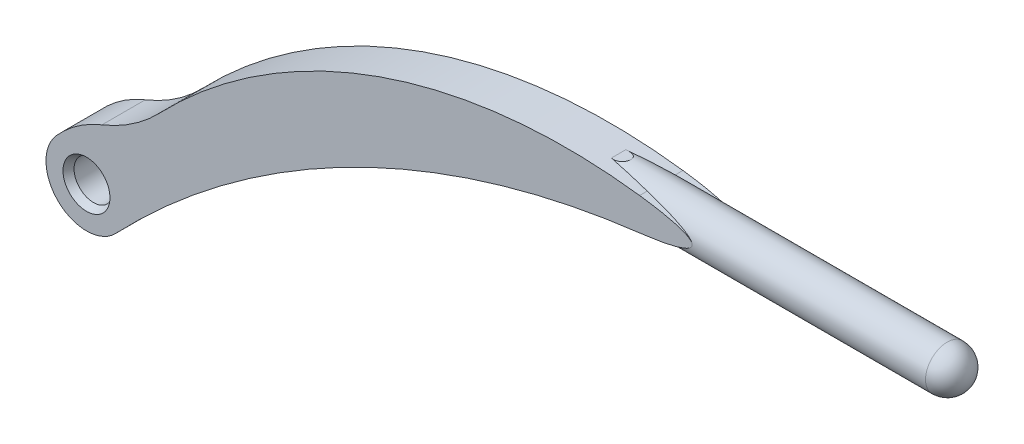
ISO-10303-21;
HEADER;
FILE_DESCRIPTION(('STEP AP214'),'2;1');
FILE_NAME('part.step','',(''),(''),'','','');
FILE_SCHEMA(('AUTOMOTIVE_DESIGN { 1 0 10303 214 1 1 1 1 }'));
ENDSEC;
DATA;
#1=APPLICATION_CONTEXT('core data for automotive mechanical design processes');
#2=APPLICATION_PROTOCOL_DEFINITION('international standard','automotive_design',2000,#1);
#3=PRODUCT_CONTEXT('',#1,'mechanical');
#4=PRODUCT('Part','Part','',(#3));
#5=PRODUCT_RELATED_PRODUCT_CATEGORY('part','',(#4));
#6=PRODUCT_DEFINITION_FORMATION('','',#4);
#7=PRODUCT_DEFINITION_CONTEXT('part definition',#1,'design');
#8=PRODUCT_DEFINITION('design','',#6,#7);
#9=PRODUCT_DEFINITION_SHAPE('','',#8);
#10=(LENGTH_UNIT() NAMED_UNIT(*) SI_UNIT(.MILLI.,.METRE.));
#11=(NAMED_UNIT(*) PLANE_ANGLE_UNIT() SI_UNIT($,.RADIAN.));
#12=(NAMED_UNIT(*) SI_UNIT($,.STERADIAN.) SOLID_ANGLE_UNIT());
#13=UNCERTAINTY_MEASURE_WITH_UNIT(LENGTH_MEASURE(1.E-05),#10,'distance_accuracy_value','');
#14=(GEOMETRIC_REPRESENTATION_CONTEXT(3) GLOBAL_UNCERTAINTY_ASSIGNED_CONTEXT((#13)) GLOBAL_UNIT_ASSIGNED_CONTEXT((#10,
#11,#12)) REPRESENTATION_CONTEXT('',''));
#15=CARTESIAN_POINT('',(0.,0.,0.));
#16=DIRECTION('',(0.,0.,1.));
#17=DIRECTION('',(1.,0.,0.));
#18=AXIS2_PLACEMENT_3D('',#15,#16,#17);
#19=CARTESIAN_POINT('',(34.6920044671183,14.6976624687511,2.7178));
#20=CARTESIAN_POINT('',(42.8662930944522,15.6704272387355,2.7178));
#21=CARTESIAN_POINT('',(34.6920044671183,16.733025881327,2.7178));
#22=(BOUNDED_CURVE() B_SPLINE_CURVE(2,(#19,#20,#21),.UNSPECIFIED.,.F.,
.F.) B_SPLINE_CURVE_WITH_KNOTS((3,3),(0.,1.),
.UNSPECIFIED.) CURVE() GEOMETRIC_REPRESENTATION_ITEM() RATIONAL_B_SPLINE_CURVE((1.,
0.677710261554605,1.)) REPRESENTATION_ITEM(''));
#23=DIRECTION('',(0.,0.,-1.));
#24=VECTOR('',#23,1.);
#25=SURFACE_OF_LINEAR_EXTRUSION('',#22,#24);
#26=CARTESIAN_POINT('',(34.6920044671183,16.733025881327,2.23848737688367));
#27=CARTESIAN_POINT('',(34.7780422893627,16.7218386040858,2.25165778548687));
#28=CARTESIAN_POINT('',(34.8640465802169,16.7102931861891,2.2647485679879));
#29=CARTESIAN_POINT('',(35.0363838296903,16.68634315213,2.29084535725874));
#30=CARTESIAN_POINT('',(35.1227163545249,16.6739346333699,2.3038506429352));
#31=CARTESIAN_POINT('',(35.2955709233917,16.6481775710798,2.32976837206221));
#32=CARTESIAN_POINT('',(35.3820925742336,16.634825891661,2.34268033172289));
#33=CARTESIAN_POINT('',(35.5551824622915,16.607077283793,2.36840059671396));
#34=CARTESIAN_POINT('',(35.6417503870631,16.5926781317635,2.38120861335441));
#35=CARTESIAN_POINT('',(35.8147860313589,16.5627021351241,2.40670861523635));
#36=CARTESIAN_POINT('',(35.9012535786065,16.5471241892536,2.41940047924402));
#37=CARTESIAN_POINT('',(36.0788626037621,16.5136903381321,2.44537434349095));
#38=CARTESIAN_POINT('',(36.1699903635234,16.4957552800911,2.45864887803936));
#39=CARTESIAN_POINT('',(36.3518164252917,16.4580868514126,2.48503905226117));
#40=CARTESIAN_POINT('',(36.4425150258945,16.4383550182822,2.49815481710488));
#41=CARTESIAN_POINT('',(36.6232926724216,16.3966813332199,2.52420668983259));
#42=CARTESIAN_POINT('',(36.7133724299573,16.3747427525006,2.53714303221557));
#43=CARTESIAN_POINT('',(36.892663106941,16.3280166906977,2.5628056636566));
#44=CARTESIAN_POINT('',(36.9818752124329,16.3032339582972,2.57553226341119));
#45=CARTESIAN_POINT('',(37.1591282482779,16.2497729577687,2.60073612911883));
#46=CARTESIAN_POINT('',(37.2471699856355,16.2210975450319,2.61321357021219));
#47=CARTESIAN_POINT('',(37.369039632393,16.1767891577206,2.63042831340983));
#48=CARTESIAN_POINT('',(37.4037447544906,16.1636356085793,2.63532399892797));
#49=CARTESIAN_POINT('',(37.4727119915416,16.1361396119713,2.64503966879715));
#50=CARTESIAN_POINT('',(37.506973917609,16.1217966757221,2.64985962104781));
#51=CARTESIAN_POINT('',(37.5748758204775,16.0916154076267,2.65939866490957));
#52=CARTESIAN_POINT('',(37.6085154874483,16.0757763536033,2.66411770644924));
#53=CARTESIAN_POINT('',(37.6748113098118,16.0421523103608,2.67340424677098));
#54=CARTESIAN_POINT('',(37.7074680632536,16.0243685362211,2.67797183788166));
#55=CARTESIAN_POINT('',(37.7715459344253,15.9859376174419,2.68692025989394));
#56=CARTESIAN_POINT('',(37.8029534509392,15.9652663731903,2.69129906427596));
#57=CARTESIAN_POINT('',(37.8477508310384,15.9312876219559,2.6975340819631));
#58=CARTESIAN_POINT('',(37.8622577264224,15.919505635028,2.69955135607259));
#59=CARTESIAN_POINT('',(37.8901778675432,15.8946991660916,2.70343034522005));
#60=CARTESIAN_POINT('',(37.9035911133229,15.8816746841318,2.7052920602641));
#61=CARTESIAN_POINT('',(37.9346607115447,15.8476471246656,2.70960014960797));
#62=CARTESIAN_POINT('',(37.9514321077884,15.8257291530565,2.71192173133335));
#63=CARTESIAN_POINT('',(37.9715547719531,15.7896832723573,2.71470329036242));
#64=CARTESIAN_POINT('',(37.977448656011,15.7770297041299,2.7155171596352));
#65=CARTESIAN_POINT('',(37.9867739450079,15.7508324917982,2.71680391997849));
#66=CARTESIAN_POINT('',(37.9902134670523,15.7372919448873,2.71727793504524));
#67=CARTESIAN_POINT('',(37.9936391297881,15.7129675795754,2.71774978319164));
#68=CARTESIAN_POINT('',(37.9942405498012,15.7022715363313,2.71783247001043));
#69=CARTESIAN_POINT('',(37.9936007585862,15.6809333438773,2.717744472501));
#70=CARTESIAN_POINT('',(37.9923592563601,15.670291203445,2.71757374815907));
#71=CARTESIAN_POINT('',(37.988181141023,15.6494235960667,2.71699988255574));
#72=CARTESIAN_POINT('',(37.985254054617,15.639196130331,2.71659804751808));
#73=CARTESIAN_POINT('',(37.9779773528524,15.6192605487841,2.71559990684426));
#74=CARTESIAN_POINT('',(37.9736248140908,15.6095535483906,2.71500320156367));
#75=CARTESIAN_POINT('',(37.960241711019,15.5839430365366,2.71316976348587));
#76=CARTESIAN_POINT('',(37.9501040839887,15.568633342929,2.7117821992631));
#77=CARTESIAN_POINT('',(37.9277065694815,15.5396919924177,2.70871980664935));
#78=CARTESIAN_POINT('',(37.9154396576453,15.526066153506,2.70704402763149));
#79=CARTESIAN_POINT('',(37.8856718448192,15.496344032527,2.7029810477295));
#80=CARTESIAN_POINT('',(37.867704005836,15.4807308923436,2.70053113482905));
#81=CARTESIAN_POINT('',(37.8304256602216,15.451321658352,2.69545326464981));
#82=CARTESIAN_POINT('',(37.8111161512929,15.437524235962,2.69282543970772));
#83=CARTESIAN_POINT('',(37.7714783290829,15.4112231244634,2.68743583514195));
#84=CARTESIAN_POINT('',(37.7511441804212,15.3987284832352,2.68467329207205));
#85=CARTESIAN_POINT('',(37.7098590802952,15.3748439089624,2.67906886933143));
#86=CARTESIAN_POINT('',(37.6889082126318,15.3634538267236,2.67622700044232));
#87=CARTESIAN_POINT('',(37.6408031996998,15.3385877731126,2.66970661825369));
#88=CARTESIAN_POINT('',(37.6135103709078,15.3253859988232,2.66601059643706));
#89=CARTESIAN_POINT('',(37.5584115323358,15.3001139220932,2.65855550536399));
#90=CARTESIAN_POINT('',(37.5306053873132,15.2880439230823,2.65479641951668));
#91=CARTESIAN_POINT('',(37.4465380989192,15.2531644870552,2.64344064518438));
#92=CARTESIAN_POINT('',(37.3897167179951,15.2317293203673,2.63577744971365));
#93=CARTESIAN_POINT('',(37.2751463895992,15.1914154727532,2.62034880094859));
#94=CARTESIAN_POINT('',(37.2173965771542,15.1725393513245,2.61258325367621));
#95=CARTESIAN_POINT('',(37.1011262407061,15.1366871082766,2.59697019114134));
#96=CARTESIAN_POINT('',(37.0426038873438,15.1197170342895,2.58912249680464));
#97=CARTESIAN_POINT('',(36.9252177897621,15.0873508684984,2.57340230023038));
#98=CARTESIAN_POINT('',(36.8663546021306,15.0719527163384,2.56552984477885));
#99=CARTESIAN_POINT('',(36.7483407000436,15.0424293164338,2.54976694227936));
#100=CARTESIAN_POINT('',(36.6891901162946,15.028303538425,2.54187650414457));
#101=CARTESIAN_POINT('',(36.5491669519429,14.99618407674,2.52322188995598));
#102=CARTESIAN_POINT('',(36.4681912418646,14.9786439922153,2.51245261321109));
#103=CARTESIAN_POINT('',(36.3058774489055,14.9451539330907,2.49090341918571));
#104=CARTESIAN_POINT('',(36.2245392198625,14.9292046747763,2.48012349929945));
#105=CARTESIAN_POINT('',(36.0615767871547,14.8986398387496,2.45856387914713));
#106=CARTESIAN_POINT('',(35.9799524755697,14.8840248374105,2.44778418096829));
#107=CARTESIAN_POINT('',(35.8164835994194,14.8559398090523,2.42623484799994));
#108=CARTESIAN_POINT('',(35.7346389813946,14.8424700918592,2.41546521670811));
#109=CARTESIAN_POINT('',(35.5728362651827,14.816857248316,2.39421429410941));
#110=CARTESIAN_POINT('',(35.4928821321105,14.8046893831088,2.38373252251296));
#111=CARTESIAN_POINT('',(35.3328690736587,14.7812031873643,2.36279558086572));
#112=CARTESIAN_POINT('',(35.2528101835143,14.7698846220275,2.35234040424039));
#113=CARTESIAN_POINT('',(35.0926373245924,14.7480137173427,2.331465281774));
#114=CARTESIAN_POINT('',(35.0125234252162,14.7374608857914,2.32104531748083));
#115=CARTESIAN_POINT('',(34.8522873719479,14.7170564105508,2.3002493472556));
#116=CARTESIAN_POINT('',(34.7721653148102,14.7072040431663,2.28987330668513));
#117=CARTESIAN_POINT('',(34.6920044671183,14.6976624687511,2.27951606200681));
#118=B_SPLINE_CURVE_WITH_KNOTS('',3,(#26,#27,#28,#29,#30,#31,#32,#33,#34,#35,#36,#37,#38,#39,
#40,#41,#42,#43,#44,#45,#46,#47,#48,#49,#50,#51,#52,#53,#54,#55,#56,#57,#58,#59,#60,#61,#62,#63,
#64,#65,#66,#67,#68,#69,#70,#71,#72,#73,#74,#75,#76,#77,#78,#79,#80,#81,#82,#83,#84,#85,#86,#87,
#88,#89,#90,#91,#92,#93,#94,#95,#96,#97,#98,#99,#100,#101,#102,#103,#104,#105,#106,#107,#108,
#109,#110,#111,#112,#113,#114,#115,#116,#117),.UNSPECIFIED.,.F.,.F.,(4,2,2,2,2,2,2,2,2,2,2,2,2,
2,2,2,2,2,2,2,2,2,2,2,2,2,2,2,2,2,2,2,2,2,2,2,2,2,2,2,2,2,2,2,2,4),(0.,0.26326856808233,
0.527816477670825,0.793289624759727,1.05934376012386,1.32564959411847,1.60709360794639,
1.88829901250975,2.16909354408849,2.44942589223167,2.72955370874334,2.84184449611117,
2.95418166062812,3.0665733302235,3.1788951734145,3.29221775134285,3.34854355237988,
3.40486935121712,3.48709487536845,3.52885649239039,3.57047934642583,3.60246308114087,
3.6344518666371,3.66626160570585,3.69813699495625,3.75305733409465,3.80816241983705,
3.87977920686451,3.95134329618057,4.02337525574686,4.09539747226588,4.18699000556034,
4.27860702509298,4.46213902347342,4.64585325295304,4.83013483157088,5.01417167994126,
5.19813147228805,5.44876223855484,5.69950534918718,5.95035626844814,6.20127483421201,
6.44592325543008,6.69050378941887,6.93492569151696,7.17909128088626),.UNSPECIFIED.);
#119=CARTESIAN_POINT('',(34.6920044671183,16.733025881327,2.23848737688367));
#120=VERTEX_POINT('',#119);
#121=CARTESIAN_POINT('',(37.9940044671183,15.6972,2.7178));
#122=VERTEX_POINT('',#121);
#123=EDGE_CURVE('E141',#120,#122,#118,.T.);
#124=ORIENTED_EDGE('',*,*,#123,.F.);
#125=DIRECTION('',(0.,0.,-1.));
#126=VECTOR('',#125,1.);
#127=CARTESIAN_POINT('',(34.6920044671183,16.733025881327,2.7178));
#128=LINE('',#127,#126);
#129=CARTESIAN_POINT('',(34.6920044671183,16.733025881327,2.7178));
#130=VERTEX_POINT('',#129);
#131=EDGE_CURVE('E155',#130,#120,#128,.T.);
#132=ORIENTED_EDGE('',*,*,#131,.F.);
#133=EDGE_CURVE('E229',#122,#130,#22,.T.);
#134=ORIENTED_EDGE('',*,*,#133,.F.);
#135=EDGE_LOOP('',(#124,#132,#134));
#136=FACE_BOUND('',#135,.T.);
#137=ADVANCED_FACE('F35',(#136),#25,.F.);
#138=CARTESIAN_POINT('',(34.6920044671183,14.6976624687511,2.27951606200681));
#139=VERTEX_POINT('',#138);
#140=EDGE_CURVE('E137',#122,#139,#118,.T.);
#141=ORIENTED_EDGE('',*,*,#140,.F.);
#142=CARTESIAN_POINT('',(34.6920044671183,14.6976624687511,2.7178));
#143=VERTEX_POINT('',#142);
#144=EDGE_CURVE('E148',#143,#122,#22,.T.);
#145=ORIENTED_EDGE('',*,*,#144,.F.);
#146=DIRECTION('',(0.,0.,-1.));
#147=VECTOR('',#146,1.);
#148=CARTESIAN_POINT('',(34.6920044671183,14.6976624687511,2.7178));
#149=LINE('',#148,#147);
#150=EDGE_CURVE('E130',#143,#139,#149,.T.);
#151=ORIENTED_EDGE('',*,*,#150,.T.);
#152=EDGE_LOOP('',(#141,#145,#151));
#153=FACE_BOUND('',#152,.T.);
#154=ADVANCED_FACE('F146',(#153),#25,.F.);
#155=CARTESIAN_POINT('',(34.6920044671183,14.6976624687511,0.438283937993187));
#156=CARTESIAN_POINT('',(34.7771209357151,14.7077944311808,0.427286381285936));
#157=CARTESIAN_POINT('',(34.862193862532,14.718276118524,0.416267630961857));
#158=CARTESIAN_POINT('',(35.0326555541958,14.7400747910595,0.394138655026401));
#159=CARTESIAN_POINT('',(35.1180437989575,14.7513956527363,0.383028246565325));
#160=CARTESIAN_POINT('',(35.2890018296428,14.7749519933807,0.36073597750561));
#161=CARTESIAN_POINT('',(35.3745711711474,14.7871906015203,0.349554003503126));
#162=CARTESIAN_POINT('',(35.5457533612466,14.8126849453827,0.327138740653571));
#163=CARTESIAN_POINT('',(35.6313658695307,14.8259429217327,0.315905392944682));
#164=CARTESIAN_POINT('',(35.8024928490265,14.853604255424,0.293407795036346));
#165=CARTESIAN_POINT('',(35.8880071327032,14.8680087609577,0.282143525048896));
#166=CARTESIAN_POINT('',(36.0663522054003,14.8994629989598,0.258607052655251));
#167=CARTESIAN_POINT('',(36.1591615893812,14.9166340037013,0.246333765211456));
#168=CARTESIAN_POINT('',(36.3443377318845,14.9528316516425,0.221796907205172));
#169=CARTESIAN_POINT('',(36.4367048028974,14.971856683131,0.209533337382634));
#170=CARTESIAN_POINT('',(36.6207946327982,15.0121990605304,0.185043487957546));
#171=CARTESIAN_POINT('',(36.7125181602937,15.03351286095,0.172817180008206));
#172=CARTESIAN_POINT('',(36.895081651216,15.0790956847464,0.148433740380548));
#173=CARTESIAN_POINT('',(36.9859228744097,15.1033595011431,0.136276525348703));
#174=CARTESIAN_POINT('',(37.1212617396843,15.1428558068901,0.118126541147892));
#175=CARTESIAN_POINT('',(37.1662074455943,15.1565334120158,0.112092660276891));
#176=CARTESIAN_POINT('',(37.2556968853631,15.1851569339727,0.100065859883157));
#177=CARTESIAN_POINT('',(37.300240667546,15.2001026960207,0.094072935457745));
#178=CARTESIAN_POINT('',(37.3770691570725,15.227423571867,0.0837246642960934));
#179=CARTESIAN_POINT('',(37.4094814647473,15.2394336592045,0.0793552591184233));
#180=CARTESIAN_POINT('',(37.4739200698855,15.2645042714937,0.0706608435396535));
#181=CARTESIAN_POINT('',(37.5059462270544,15.2775651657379,0.0663358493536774));
#182=CARTESIAN_POINT('',(37.5692073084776,15.3048841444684,0.0577847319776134));
#183=CARTESIAN_POINT('',(37.6004464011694,15.3191323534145,0.0535581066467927));
#184=CARTESIAN_POINT('',(37.6621314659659,15.3492673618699,0.0452038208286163));
#185=CARTESIAN_POINT('',(37.6925778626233,15.3651532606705,0.0410761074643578));
#186=CARTESIAN_POINT('',(37.7425354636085,15.3936028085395,0.0342957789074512));
#187=CARTESIAN_POINT('',(37.7623811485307,15.4055654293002,0.0316002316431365));
#188=CARTESIAN_POINT('',(37.8013745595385,15.4308306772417,0.0262996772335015));
#189=CARTESIAN_POINT('',(37.8205181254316,15.444139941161,0.0236952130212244));
#190=CARTESIAN_POINT('',(37.8628462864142,15.4763912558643,0.0179314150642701));
#191=CARTESIAN_POINT('',(37.8856411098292,15.4958614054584,0.0148236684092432));
#192=CARTESIAN_POINT('',(37.9274388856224,15.5385914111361,0.00911759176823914));
#193=CARTESIAN_POINT('',(37.9464738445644,15.5618159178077,0.00651496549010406));
#194=CARTESIAN_POINT('',(37.9675673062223,15.5974814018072,0.00362684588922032));
#195=CARTESIAN_POINT('',(37.9729153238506,15.6079058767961,0.00289403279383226));
#196=CARTESIAN_POINT('',(37.9820098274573,15.6294489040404,0.0016471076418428));
#197=CARTESIAN_POINT('',(37.9857580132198,15.6405667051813,0.00113276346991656));
#198=CARTESIAN_POINT('',(37.9913022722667,15.6634208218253,0.000371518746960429));
#199=CARTESIAN_POINT('',(37.9930785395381,15.6751621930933,0.000127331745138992));
#200=CARTESIAN_POINT('',(37.9943701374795,15.6987723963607,-5.02769918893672E-05));
#201=CARTESIAN_POINT('',(37.9938862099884,15.7106411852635,1.61993072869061E-05));
#202=CARTESIAN_POINT('',(37.9909034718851,15.7328533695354,0.000427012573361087));
#203=CARTESIAN_POINT('',(37.9886183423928,15.7432275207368,0.000741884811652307));
#204=CARTESIAN_POINT('',(37.9825322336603,15.7635220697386,0.00158128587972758));
#205=CARTESIAN_POINT('',(37.9787283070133,15.7734415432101,0.00210622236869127));
#206=CARTESIAN_POINT('',(37.967221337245,15.7985431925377,0.00369543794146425));
#207=CARTESIAN_POINT('',(37.9585525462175,15.8132700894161,0.00489375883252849));
#208=CARTESIAN_POINT('',(37.9391274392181,15.8412409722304,0.00758203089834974));
#209=CARTESIAN_POINT('',(37.9283647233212,15.8544802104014,0.00907287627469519));
#210=CARTESIAN_POINT('',(37.9029140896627,15.8824881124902,0.0126017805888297));
#211=CARTESIAN_POINT('',(37.8878865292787,15.8969371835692,0.0146876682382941));
#212=CARTESIAN_POINT('',(37.8565703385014,15.9242981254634,0.0190392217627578));
#213=CARTESIAN_POINT('',(37.8402826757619,15.9372111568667,0.0213047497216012));
#214=CARTESIAN_POINT('',(37.8067448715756,15.9619212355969,0.0259743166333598));
#215=CARTESIAN_POINT('',(37.7894891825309,15.9737105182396,0.0283791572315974));
#216=CARTESIAN_POINT('',(37.754371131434,15.9963124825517,0.0332779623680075));
#217=CARTESIAN_POINT('',(37.7365088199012,16.0071252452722,0.0357719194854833));
#218=CARTESIAN_POINT('',(37.6750096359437,16.0425681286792,0.0443661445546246));
#219=CARTESIAN_POINT('',(37.630323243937,16.0653327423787,0.0506236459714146));
#220=CARTESIAN_POINT('',(37.5395402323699,16.1079021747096,0.0633612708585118));
#221=CARTESIAN_POINT('',(37.4934410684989,16.1277012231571,0.0698417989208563));
#222=CARTESIAN_POINT('',(37.4003454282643,16.1651350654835,0.0829535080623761));
#223=CARTESIAN_POINT('',(37.3533481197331,16.1827677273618,0.0895848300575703));
#224=CARTESIAN_POINT('',(37.2585804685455,16.2164350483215,0.102980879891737));
#225=CARTESIAN_POINT('',(37.2108076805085,16.2324625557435,0.109746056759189));
#226=CARTESIAN_POINT('',(37.1149106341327,16.263157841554,0.123350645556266));
#227=CARTESIAN_POINT('',(37.0667869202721,16.2778273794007,0.130189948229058));
#228=CARTESIAN_POINT('',(36.9702519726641,16.3060617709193,0.143934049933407));
#229=CARTESIAN_POINT('',(36.9218408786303,16.3196271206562,0.15083881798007));
#230=CARTESIAN_POINT('',(36.7822253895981,16.3573336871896,0.170787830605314));
#231=CARTESIAN_POINT('',(36.6907192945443,16.3803184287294,0.183906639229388));
#232=CARTESIAN_POINT('',(36.5071045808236,16.4238536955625,0.210322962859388));
#233=CARTESIAN_POINT('',(36.4149956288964,16.4444027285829,0.223620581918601));
#234=CARTESIAN_POINT('',(36.2303247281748,16.4835548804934,0.250379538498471));
#235=CARTESIAN_POINT('',(36.1377625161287,16.5021566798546,0.263840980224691));
#236=CARTESIAN_POINT('',(35.952310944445,16.5377488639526,0.290917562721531));
#237=CARTESIAN_POINT('',(35.8594214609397,16.5547385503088,0.304532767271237));
#238=CARTESIAN_POINT('',(35.6770679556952,16.5867048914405,0.33137463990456));
#239=CARTESIAN_POINT('',(35.5876123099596,16.6017343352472,0.34459563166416));
#240=CARTESIAN_POINT('',(35.4085856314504,16.6306818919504,0.371172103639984));
#241=CARTESIAN_POINT('',(35.319014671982,16.6446005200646,0.384527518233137));
#242=CARTESIAN_POINT('',(35.1398468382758,16.6714486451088,0.411372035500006));
#243=CARTESIAN_POINT('',(35.0502500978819,16.6843792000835,0.424860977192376));
#244=CARTESIAN_POINT('',(34.8711156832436,16.7093433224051,0.451975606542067));
#245=CARTESIAN_POINT('',(34.7815781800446,16.7213784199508,0.465601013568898));
#246=CARTESIAN_POINT('',(34.6920044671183,16.733025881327,0.47931262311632));
#247=B_SPLINE_CURVE_WITH_KNOTS('',3,(#155,#156,#157,#158,#159,#160,#161,#162,#163,#164,#165,
#166,#167,#168,#169,#170,#171,#172,#173,#174,#175,#176,#177,#178,#179,#180,#181,#182,#183,#184,
#185,#186,#187,#188,#189,#190,#191,#192,#193,#194,#195,#196,#197,#198,#199,#200,#201,#202,#203,
#204,#205,#206,#207,#208,#209,#210,#211,#212,#213,#214,#215,#216,#217,#218,#219,#220,#221,#222,
#223,#224,#225,#226,#227,#228,#229,#230,#231,#232,#233,#234,#235,#236,#237,#238,#239,#240,#241,
#242,#243,#244,#245,#246),.UNSPECIFIED.,.F.,.F.,(4,2,2,2,2,2,2,2,2,2,2,2,2,2,2,2,2,2,2,2,2,2,2,
2,2,2,2,2,2,2,2,2,2,2,2,2,2,2,2,2,2,2,2,2,2,4),(0.,0.25926048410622,0.519803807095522,
0.781279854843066,1.04334804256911,1.30568206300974,1.59120397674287,1.87647986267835,
2.16132003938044,2.4456645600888,2.58775111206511,2.7298203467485,2.83432948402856,
2.93887551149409,3.04262530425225,3.14631833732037,3.21626954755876,3.28658405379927,
3.3767995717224,3.46621045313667,3.50132296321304,3.53639807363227,3.57182237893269,
3.60723505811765,3.63898324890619,3.67079335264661,3.72188832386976,3.77314198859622,
3.83585189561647,3.89851411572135,3.96158194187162,4.02464452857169,4.17605903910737,
4.32776443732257,4.47961795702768,4.63212047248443,4.78442254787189,4.93665581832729,
5.22237470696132,5.50826775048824,5.79435329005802,6.08056220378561,6.35555793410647,
6.63042536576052,6.90499421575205,7.17908254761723),.UNSPECIFIED.);
#248=CARTESIAN_POINT('',(34.6920044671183,14.6976624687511,0.438283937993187));
#249=VERTEX_POINT('',#248);
#250=CARTESIAN_POINT('',(37.9940044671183,15.6972,0.));
#251=VERTEX_POINT('',#250);
#252=EDGE_CURVE('E144',#249,#251,#247,.T.);
#253=ORIENTED_EDGE('',*,*,#252,.F.);
#254=CARTESIAN_POINT('',(34.6920044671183,14.6976624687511,0.));
#255=VERTEX_POINT('',#254);
#256=EDGE_CURVE('E151',#249,#255,#149,.T.);
#257=ORIENTED_EDGE('',*,*,#256,.T.);
#258=CARTESIAN_POINT('',(34.6920044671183,14.6976624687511,0.));
#259=CARTESIAN_POINT('',(42.8662930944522,15.6704272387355,0.));
#260=CARTESIAN_POINT('',(34.6920044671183,16.733025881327,0.));
#261=(BOUNDED_CURVE() B_SPLINE_CURVE(2,(#258,#259,#260),.UNSPECIFIED.,.F.,
.F.) B_SPLINE_CURVE_WITH_KNOTS((3,3),(0.,1.),
.UNSPECIFIED.) CURVE() GEOMETRIC_REPRESENTATION_ITEM() RATIONAL_B_SPLINE_CURVE((1.,
0.677710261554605,1.)) REPRESENTATION_ITEM(''));
#262=EDGE_CURVE('E249',#255,#251,#261,.T.);
#263=ORIENTED_EDGE('',*,*,#262,.T.);
#264=EDGE_LOOP('',(#253,#257,#263));
#265=FACE_BOUND('',#264,.T.);
#266=ADVANCED_FACE('F323',(#265),#25,.F.);
#267=CARTESIAN_POINT('',(34.6920044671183,16.733025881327,0.479312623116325));
#268=VERTEX_POINT('',#267);
#269=EDGE_CURVE('E150',#251,#268,#247,.T.);
#270=ORIENTED_EDGE('',*,*,#269,.F.);
#271=CARTESIAN_POINT('',(34.6920044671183,16.733025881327,0.));
#272=VERTEX_POINT('',#271);
#273=EDGE_CURVE('E248',#251,#272,#261,.T.);
#274=ORIENTED_EDGE('',*,*,#273,.T.);
#275=EDGE_CURVE('E273',#268,#272,#128,.T.);
#276=ORIENTED_EDGE('',*,*,#275,.F.);
#277=EDGE_LOOP('',(#270,#274,#276));
#278=FACE_BOUND('',#277,.T.);
#279=ADVANCED_FACE('F319',(#278),#25,.F.);
#280=CARTESIAN_POINT('',(41.0972,-39.1261586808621,2.7178));
#281=DIRECTION('',(0.,0.,-1.));
#282=DIRECTION('',(-1.,0.,0.));
#283=AXIS2_PLACEMENT_3D('',#280,#281,#282);
#284=PLANE('',#283);
#285=CARTESIAN_POINT('',(0.,0.,2.7178));
#286=DIRECTION('',(0.,0.,-1.));
#287=DIRECTION('',(-1.,0.,0.));
#288=AXIS2_PLACEMENT_3D('',#285,#286,#287);
#289=CIRCLE('',#288,1.4732);
#290=CARTESIAN_POINT('',(-1.4732,0.,2.7178));
#291=VERTEX_POINT('',#290);
#292=EDGE_CURVE('E301',#291,#291,#289,.T.);
#293=ORIENTED_EDGE('',*,*,#292,.T.);
#294=EDGE_LOOP('',(#293));
#295=FACE_BOUND('',#294,.T.);
#296=ORIENTED_EDGE('',*,*,#144,.T.);
#297=ORIENTED_EDGE('',*,*,#133,.T.);
#298=CARTESIAN_POINT('',(30.1244,-18.4043399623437,2.7178));
#299=DIRECTION('',(0.,0.,1.));
#300=DIRECTION('',(-1.,0.,0.));
#301=AXIS2_PLACEMENT_3D('',#298,#299,#300);
#302=CIRCLE('',#301,35.433);
#303=CARTESIAN_POINT('',(4.56778312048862,6.13861875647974,2.7178));
#304=VERTEX_POINT('',#303);
#305=EDGE_CURVE('E235',#130,#304,#302,.T.);
#306=ORIENTED_EDGE('',*,*,#305,.T.);
#307=CARTESIAN_POINT('',(-2.8702,13.2815873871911,2.7178));
#308=DIRECTION('',(0.,0.,-1.));
#309=DIRECTION('',(1.,0.,0.));
#310=AXIS2_PLACEMENT_3D('',#307,#308,#309);
#311=CIRCLE('',#310,10.3124);
#312=CARTESIAN_POINT('',(0.971388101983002,3.71143615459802,2.7178));
#313=VERTEX_POINT('',#312);
#314=EDGE_CURVE('E240',#304,#313,#311,.T.);
#315=ORIENTED_EDGE('',*,*,#314,.T.);
#316=CARTESIAN_POINT('',(3.81,-3.36010416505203,2.7178));
#317=DIRECTION('',(0.,0.,1.));
#318=DIRECTION('',(-1.,0.,0.));
#319=AXIS2_PLACEMENT_3D('',#316,#317,#318);
#320=CIRCLE('',#319,7.62);
#321=CARTESIAN_POINT('',(-1.905,1.68005208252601,2.7178));
#322=VERTEX_POINT('',#321);
#323=EDGE_CURVE('E242',#313,#322,#320,.T.);
#324=ORIENTED_EDGE('',*,*,#323,.T.);
#325=CARTESIAN_POINT('',(0.,0.,2.7178));
#326=DIRECTION('',(0.,0.,1.));
#327=DIRECTION('',(-1.,0.,0.));
#328=AXIS2_PLACEMENT_3D('',#325,#326,#327);
#329=CIRCLE('',#328,2.54);
#330=CARTESIAN_POINT('',(1.83962399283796,-1.75139474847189,2.7178));
#331=VERTEX_POINT('',#330);
#332=EDGE_CURVE('E244',#322,#331,#329,.T.);
#333=ORIENTED_EDGE('',*,*,#332,.T.);
#334=CARTESIAN_POINT('',(41.0972,-39.1261586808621,2.7178));
#335=DIRECTION('',(0.,0.,-1.));
#336=DIRECTION('',(-1.,0.,0.));
#337=AXIS2_PLACEMENT_3D('',#334,#335,#336);
#338=CIRCLE('',#337,54.2036);
#339=EDGE_CURVE('E228',#331,#143,#338,.T.);
#340=ORIENTED_EDGE('',*,*,#339,.T.);
#341=EDGE_LOOP('',(#296,#297,#306,#315,#324,#333,#340));
#342=FACE_BOUND('',#341,.T.);
#343=ADVANCED_FACE('F325',(#295,#342),#284,.F.);
#344=CARTESIAN_POINT('',(41.0972,-39.1261586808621,0.));
#345=DIRECTION('',(0.,0.,-1.));
#346=DIRECTION('',(-1.,0.,0.));
#347=AXIS2_PLACEMENT_3D('',#344,#345,#346);
#348=PLANE('',#347);
#349=CARTESIAN_POINT('',(0.,0.,0.));
#350=DIRECTION('',(0.,0.,-1.));
#351=DIRECTION('',(-1.,0.,0.));
#352=AXIS2_PLACEMENT_3D('',#349,#350,#351);
#353=CIRCLE('',#352,1.6591409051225);
#354=CARTESIAN_POINT('',(-1.6591409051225,0.,0.));
#355=VERTEX_POINT('',#354);
#356=EDGE_CURVE('E290',#355,#355,#353,.F.);
#357=ORIENTED_EDGE('',*,*,#356,.T.);
#358=EDGE_LOOP('',(#357));
#359=FACE_BOUND('',#358,.T.);
#360=ORIENTED_EDGE('',*,*,#273,.F.);
#361=ORIENTED_EDGE('',*,*,#262,.F.);
#362=CARTESIAN_POINT('',(41.0972,-39.1261586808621,0.));
#363=DIRECTION('',(0.,0.,-1.));
#364=DIRECTION('',(-1.,0.,0.));
#365=AXIS2_PLACEMENT_3D('',#362,#363,#364);
#366=CIRCLE('',#365,54.2036);
#367=CARTESIAN_POINT('',(1.83962399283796,-1.75139474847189,0.));
#368=VERTEX_POINT('',#367);
#369=EDGE_CURVE('E226',#368,#255,#366,.T.);
#370=ORIENTED_EDGE('',*,*,#369,.F.);
#371=CARTESIAN_POINT('',(0.,0.,0.));
#372=DIRECTION('',(0.,0.,1.));
#373=DIRECTION('',(-1.,0.,0.));
#374=AXIS2_PLACEMENT_3D('',#371,#372,#373);
#375=CIRCLE('',#374,2.54);
#376=CARTESIAN_POINT('',(-1.905,1.68005208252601,0.));
#377=VERTEX_POINT('',#376);
#378=EDGE_CURVE('E230',#377,#368,#375,.T.);
#379=ORIENTED_EDGE('',*,*,#378,.F.);
#380=CARTESIAN_POINT('',(3.81,-3.36010416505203,0.));
#381=DIRECTION('',(0.,0.,1.));
#382=DIRECTION('',(-1.,0.,0.));
#383=AXIS2_PLACEMENT_3D('',#380,#381,#382);
#384=CIRCLE('',#383,7.62);
#385=CARTESIAN_POINT('',(0.971388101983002,3.71143615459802,0.));
#386=VERTEX_POINT('',#385);
#387=EDGE_CURVE('E261',#386,#377,#384,.T.);
#388=ORIENTED_EDGE('',*,*,#387,.F.);
#389=CARTESIAN_POINT('',(-2.8702,13.2815873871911,0.));
#390=DIRECTION('',(0.,0.,-1.));
#391=DIRECTION('',(1.,0.,0.));
#392=AXIS2_PLACEMENT_3D('',#389,#390,#391);
#393=CIRCLE('',#392,10.3124);
#394=CARTESIAN_POINT('',(4.56778312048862,6.13861875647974,0.));
#395=VERTEX_POINT('',#394);
#396=EDGE_CURVE('E259',#395,#386,#393,.T.);
#397=ORIENTED_EDGE('',*,*,#396,.F.);
#398=CARTESIAN_POINT('',(30.1244,-18.4043399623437,0.));
#399=DIRECTION('',(0.,0.,1.));
#400=DIRECTION('',(-1.,0.,0.));
#401=AXIS2_PLACEMENT_3D('',#398,#399,#400);
#402=CIRCLE('',#401,35.433);
#403=EDGE_CURVE('E254',#272,#395,#402,.T.);
#404=ORIENTED_EDGE('',*,*,#403,.F.);
#405=EDGE_LOOP('',(#360,#361,#370,#379,#388,#397,#404));
#406=FACE_BOUND('',#405,.T.);
#407=ADVANCED_FACE('F331',(#359,#406),#348,.T.);
#408=CARTESIAN_POINT('',(41.0972,-39.1261586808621,2.7178));
#409=DIRECTION('',(0.,0.,-1.));
#410=DIRECTION('',(-1.,0.,0.));
#411=AXIS2_PLACEMENT_3D('',#408,#409,#410);
#412=CYLINDRICAL_SURFACE('',#411,54.2036);
#413=ORIENTED_EDGE('',*,*,#256,.F.);
#414=CARTESIAN_POINT('',(34.6920044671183,14.6976624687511,0.438283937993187));
#415=CARTESIAN_POINT('',(34.644377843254,14.6919946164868,0.44442728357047));
#416=CARTESIAN_POINT('',(34.5967851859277,14.6862669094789,0.450764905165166));
#417=CARTESIAN_POINT('',(34.5016678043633,14.6746917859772,0.463828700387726));
#418=CARTESIAN_POINT('',(34.4541430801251,14.6688443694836,0.470554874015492));
#419=CARTESIAN_POINT('',(34.406652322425,14.6629370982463,0.477475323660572));
#420=B_SPLINE_CURVE_WITH_KNOTS('',3,(#414,#415,#416,#417,#418,#419),.UNSPECIFIED.,.F.,.F.,(4,2,
4),(0.,0.145059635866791,0.290119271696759),.UNSPECIFIED.);
#421=CARTESIAN_POINT('',(34.4066523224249,14.6629370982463,0.477475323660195));
#422=VERTEX_POINT('',#421);
#423=EDGE_CURVE('E55',#249,#422,#420,.T.);
#424=ORIENTED_EDGE('',*,*,#423,.T.);
#425=DIRECTION('',(0.,0.,-1.));
#426=VECTOR('',#425,1.);
#427=CARTESIAN_POINT('',(34.4066523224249,14.6629370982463,2.7178));
#428=LINE('',#427,#426);
#429=CARTESIAN_POINT('',(34.4066523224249,14.6629370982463,2.24032467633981));
#430=VERTEX_POINT('',#429);
#431=EDGE_CURVE('E132',#422,#430,#428,.F.);
#432=ORIENTED_EDGE('',*,*,#431,.T.);
#433=CARTESIAN_POINT('',(34.4066523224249,14.6629370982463,2.24032467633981));
#434=CARTESIAN_POINT('',(34.4541430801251,14.6688443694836,2.24724512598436));
#435=CARTESIAN_POINT('',(34.5016678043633,14.6746917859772,2.253971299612));
#436=CARTESIAN_POINT('',(34.5967851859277,14.6862669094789,2.26703509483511));
#437=CARTESIAN_POINT('',(34.6443778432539,14.6919946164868,2.27337271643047));
#438=CARTESIAN_POINT('',(34.692004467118,14.6976624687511,2.27951606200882));
#439=B_SPLINE_CURVE_WITH_KNOTS('',3,(#433,#434,#435,#436,#437,#438),.UNSPECIFIED.,.F.,.F.,(4,2,
4),(0.,0.145059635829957,0.290119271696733),.UNSPECIFIED.);
#440=EDGE_CURVE('E125',#430,#139,#439,.T.);
#441=ORIENTED_EDGE('',*,*,#440,.T.);
#442=ORIENTED_EDGE('',*,*,#150,.F.);
#443=ORIENTED_EDGE('',*,*,#339,.F.);
#444=DIRECTION('',(0.,0.,-1.));
#445=VECTOR('',#444,1.);
#446=CARTESIAN_POINT('',(1.83962399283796,-1.75139474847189,2.7178));
#447=LINE('',#446,#445);
#448=EDGE_CURVE('E246',#331,#368,#447,.T.);
#449=ORIENTED_EDGE('',*,*,#448,.T.);
#450=ORIENTED_EDGE('',*,*,#369,.T.);
#451=EDGE_LOOP('',(#413,#424,#432,#441,#442,#443,#449,#450));
#452=FACE_BOUND('',#451,.T.);
#453=ADVANCED_FACE('F127',(#452),#412,.F.);
#454=CARTESIAN_POINT('',(30.1244,-18.4043399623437,2.7178));
#455=DIRECTION('',(0.,0.,-1.));
#456=DIRECTION('',(-1.,0.,0.));
#457=AXIS2_PLACEMENT_3D('',#454,#455,#456);
#458=CYLINDRICAL_SURFACE('',#457,35.433);
#459=DIRECTION('',(0.,0.,-1.));
#460=VECTOR('',#459,1.);
#461=CARTESIAN_POINT('',(32.0163787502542,16.9781119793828,2.7178));
#462=LINE('',#461,#460);
#463=CARTESIAN_POINT('',(32.0163787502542,16.9781119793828,1.81263308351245));
#464=VERTEX_POINT('',#463);
#465=CARTESIAN_POINT('',(32.0163787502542,16.9781119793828,0.905166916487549));
#466=VERTEX_POINT('',#465);
#467=EDGE_CURVE('E305',#464,#466,#462,.T.);
#468=ORIENTED_EDGE('',*,*,#467,.T.);
#469=CARTESIAN_POINT('',(32.0163787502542,16.9781119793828,0.905166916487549));
#470=CARTESIAN_POINT('',(32.1283474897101,16.972124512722,0.88824801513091));
#471=CARTESIAN_POINT('',(32.2402264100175,16.9656093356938,0.870936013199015));
#472=CARTESIAN_POINT('',(32.4638357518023,16.9515235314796,0.835797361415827));
#473=CARTESIAN_POINT('',(32.5755661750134,16.9439529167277,0.81797071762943));
#474=CARTESIAN_POINT('',(32.9105043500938,16.9196635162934,0.764138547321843));
#475=CARTESIAN_POINT('',(33.1335401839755,16.901362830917,0.727768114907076));
#476=CARTESIAN_POINT('',(33.5792756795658,16.8605350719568,0.655344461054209));
#477=CARTESIAN_POINT('',(33.8019753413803,16.8380079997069,0.619291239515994));
#478=CARTESIAN_POINT('',(34.2471600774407,16.7887060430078,0.548279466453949));
#479=CARTESIAN_POINT('',(34.469645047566,16.76192965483,0.513321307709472));
#480=CARTESIAN_POINT('',(34.6920044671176,16.7330258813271,0.479312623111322));
#481=B_SPLINE_CURVE_WITH_KNOTS('',3,(#469,#470,#471,#472,#473,#474,#475,#476,#477,#478,#479,
#480),.UNSPECIFIED.,.F.,.F.,(4,2,2,2,2,4),(0.,0.340188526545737,0.680373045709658,
1.36049530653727,2.04061735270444,2.72098061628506),.UNSPECIFIED.);
#482=EDGE_CURVE('E192',#466,#268,#481,.T.);
#483=ORIENTED_EDGE('',*,*,#482,.T.);
#484=ORIENTED_EDGE('',*,*,#275,.T.);
#485=ORIENTED_EDGE('',*,*,#403,.T.);
#486=DIRECTION('',(0.,0.,-1.));
#487=VECTOR('',#486,1.);
#488=CARTESIAN_POINT('',(4.56778312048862,6.13861875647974,2.7178));
#489=LINE('',#488,#487);
#490=EDGE_CURVE('E271',#304,#395,#489,.T.);
#491=ORIENTED_EDGE('',*,*,#490,.F.);
#492=ORIENTED_EDGE('',*,*,#305,.F.);
#493=ORIENTED_EDGE('',*,*,#131,.T.);
#494=CARTESIAN_POINT('',(34.6920044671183,16.733025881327,2.23848737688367));
#495=CARTESIAN_POINT('',(34.4696450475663,16.76192965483,2.20447869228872));
#496=CARTESIAN_POINT('',(34.2471600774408,16.7887060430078,2.16952053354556));
#497=CARTESIAN_POINT('',(33.8019753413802,16.8380079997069,2.09850876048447));
#498=CARTESIAN_POINT('',(33.5792756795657,16.8605350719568,2.06245553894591));
#499=CARTESIAN_POINT('',(33.1335401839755,16.901362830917,1.99003188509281));
#500=CARTESIAN_POINT('',(32.9105043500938,16.9196635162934,1.95366145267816));
#501=CARTESIAN_POINT('',(32.5755661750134,16.9439529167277,1.89982928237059));
#502=CARTESIAN_POINT('',(32.4638357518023,16.9515235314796,1.88200263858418));
#503=CARTESIAN_POINT('',(32.2402264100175,16.9656093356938,1.84686398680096));
#504=CARTESIAN_POINT('',(32.1283474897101,16.972124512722,1.82955198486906));
#505=CARTESIAN_POINT('',(32.0163787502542,16.9781119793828,1.81263308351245));
#506=B_SPLINE_CURVE_WITH_KNOTS('',3,(#494,#495,#496,#497,#498,#499,#500,#501,#502,#503,#504,
#505),.UNSPECIFIED.,.F.,.F.,(4,2,2,2,2,4),(0.,0.680363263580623,1.36048530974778,
2.04060757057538,2.38079208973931,2.72098061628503),.UNSPECIFIED.);
#507=EDGE_CURVE('E184',#120,#464,#506,.T.);
#508=ORIENTED_EDGE('',*,*,#507,.T.);
#509=EDGE_LOOP('',(#468,#483,#484,#485,#491,#492,#493,#508));
#510=FACE_BOUND('',#509,.T.);
#511=ADVANCED_FACE('F287',(#510),#458,.T.);
#512=CARTESIAN_POINT('',(-2.8702,13.2815873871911,2.7178));
#513=DIRECTION('',(0.,0.,-1.));
#514=DIRECTION('',(-1.,0.,0.));
#515=AXIS2_PLACEMENT_3D('',#512,#513,#514);
#516=CYLINDRICAL_SURFACE('',#515,10.3124);
#517=ORIENTED_EDGE('',*,*,#396,.T.);
#518=DIRECTION('',(0.,0.,-1.));
#519=VECTOR('',#518,1.);
#520=CARTESIAN_POINT('',(0.971388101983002,3.71143615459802,2.7178));
#521=LINE('',#520,#519);
#522=EDGE_CURVE('E269',#313,#386,#521,.T.);
#523=ORIENTED_EDGE('',*,*,#522,.F.);
#524=ORIENTED_EDGE('',*,*,#314,.F.);
#525=ORIENTED_EDGE('',*,*,#490,.T.);
#526=EDGE_LOOP('',(#517,#523,#524,#525));
#527=FACE_BOUND('',#526,.T.);
#528=ADVANCED_FACE('F340',(#527),#516,.F.);
#529=CARTESIAN_POINT('',(3.81,-3.36010416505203,2.7178));
#530=DIRECTION('',(0.,0.,-1.));
#531=DIRECTION('',(-1.,0.,0.));
#532=AXIS2_PLACEMENT_3D('',#529,#530,#531);
#533=CYLINDRICAL_SURFACE('',#532,7.62);
#534=ORIENTED_EDGE('',*,*,#387,.T.);
#535=DIRECTION('',(0.,0.,-1.));
#536=VECTOR('',#535,1.);
#537=CARTESIAN_POINT('',(-1.905,1.68005208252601,2.7178));
#538=LINE('',#537,#536);
#539=EDGE_CURVE('E266',#322,#377,#538,.T.);
#540=ORIENTED_EDGE('',*,*,#539,.F.);
#541=ORIENTED_EDGE('',*,*,#323,.F.);
#542=ORIENTED_EDGE('',*,*,#522,.T.);
#543=EDGE_LOOP('',(#534,#540,#541,#542));
#544=FACE_BOUND('',#543,.T.);
#545=ADVANCED_FACE('F350',(#544),#533,.T.);
#546=CARTESIAN_POINT('',(0.,0.,2.7178));
#547=DIRECTION('',(0.,0.,-1.));
#548=DIRECTION('',(-1.,0.,0.));
#549=AXIS2_PLACEMENT_3D('',#546,#547,#548);
#550=CYLINDRICAL_SURFACE('',#549,2.54);
#551=ORIENTED_EDGE('',*,*,#378,.T.);
#552=ORIENTED_EDGE('',*,*,#448,.F.);
#553=ORIENTED_EDGE('',*,*,#332,.F.);
#554=ORIENTED_EDGE('',*,*,#539,.T.);
#555=EDGE_LOOP('',(#551,#552,#553,#554));
#556=FACE_BOUND('',#555,.T.);
#557=ADVANCED_FACE('F348',(#556),#550,.T.);
#558=CARTESIAN_POINT('',(0.,0.,2.7178));
#559=DIRECTION('',(0.,0.,-1.));
#560=DIRECTION('',(-1.,0.,0.));
#561=AXIS2_PLACEMENT_3D('',#558,#559,#560);
#562=CYLINDRICAL_SURFACE('',#561,1.2192);
#563=CARTESIAN_POINT('',(0.,0.,0.253999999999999));
#564=DIRECTION('',(0.,0.,-1.));
#565=DIRECTION('',(-1.,0.,0.));
#566=AXIS2_PLACEMENT_3D('',#563,#564,#565);
#567=CIRCLE('',#566,1.2192);
#568=CARTESIAN_POINT('',(-1.2192,0.,0.253999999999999));
#569=VERTEX_POINT('',#568);
#570=EDGE_CURVE('E297',#569,#569,#567,.T.);
#571=ORIENTED_EDGE('',*,*,#570,.T.);
#572=EDGE_LOOP('',(#571));
#573=FACE_BOUND('',#572,.T.);
#574=CARTESIAN_POINT('',(0.,0.,2.27785909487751));
#575=DIRECTION('',(0.,0.,-1.));
#576=DIRECTION('',(-1.,0.,0.));
#577=AXIS2_PLACEMENT_3D('',#574,#575,#576);
#578=CIRCLE('',#577,1.2192);
#579=CARTESIAN_POINT('',(-1.2192,0.,2.27785909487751));
#580=VERTEX_POINT('',#579);
#581=EDGE_CURVE('E292',#580,#580,#578,.F.);
#582=ORIENTED_EDGE('',*,*,#581,.T.);
#583=EDGE_LOOP('',(#582));
#584=FACE_BOUND('',#583,.T.);
#585=ADVANCED_FACE('F175',(#573,#584),#562,.F.);
#586=CARTESIAN_POINT('',(52.6244044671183,15.6972,1.3589));
#587=DIRECTION('',(-1.,0.,0.));
#588=DIRECTION('',(0.,0.,1.));
#589=AXIS2_PLACEMENT_3D('',#586,#587,#588);
#590=CYLINDRICAL_SURFACE('',#589,1.3589);
#591=CARTESIAN_POINT('',(52.6244044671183,15.6972,1.3589));
#592=DIRECTION('',(1.,0.,0.));
#593=DIRECTION('',(0.,0.,-1.));
#594=AXIS2_PLACEMENT_3D('',#591,#592,#593);
#595=CIRCLE('',#594,1.3589);
#596=CARTESIAN_POINT('',(52.6244044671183,15.6972,0.));
#597=VERTEX_POINT('',#596);
#598=EDGE_CURVE('E223',#597,#597,#595,.T.);
#599=ORIENTED_EDGE('',*,*,#598,.F.);
#600=EDGE_LOOP('',(#599));
#601=FACE_BOUND('',#600,.T.);
#602=ORIENTED_EDGE('',*,*,#482,.F.);
#603=CARTESIAN_POINT('',(32.0163787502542,16.9781119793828,0.905166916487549));
#604=CARTESIAN_POINT('',(32.055491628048,16.975997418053,0.899302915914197));
#605=CARTESIAN_POINT('',(32.0950348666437,16.9748124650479,0.895984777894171));
#606=CARTESIAN_POINT('',(32.1743706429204,16.9742823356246,0.894468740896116));
#607=CARTESIAN_POINT('',(32.2141635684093,16.9749436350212,0.896288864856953));
#608=CARTESIAN_POINT('',(32.2931143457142,16.9781016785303,0.905120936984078));
#609=CARTESIAN_POINT('',(32.3322719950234,16.9805989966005,0.91213450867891));
#610=CARTESIAN_POINT('',(32.4090447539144,16.9872355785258,0.931668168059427));
#611=CARTESIAN_POINT('',(32.4466613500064,16.991373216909,0.944182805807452));
#612=CARTESIAN_POINT('',(32.5124644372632,17.0000183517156,0.972317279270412));
#613=CARTESIAN_POINT('',(32.5411067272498,17.0043152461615,0.986932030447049));
#614=CARTESIAN_POINT('',(32.5957015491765,17.0133898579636,1.02044051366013));
#615=CARTESIAN_POINT('',(32.6216575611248,17.0181669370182,1.03932860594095));
#616=CARTESIAN_POINT('',(32.6641802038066,17.026590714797,1.07675194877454));
#617=CARTESIAN_POINT('',(32.6815376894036,17.0302465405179,1.09438365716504));
#618=CARTESIAN_POINT('',(32.7132020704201,17.0372078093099,1.13227757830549));
#619=CARTESIAN_POINT('',(32.7275122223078,17.0405136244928,1.15253694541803));
#620=CARTESIAN_POINT('',(32.7502082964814,17.045912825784,1.19184193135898));
#621=CARTESIAN_POINT('',(32.7591831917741,17.0481163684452,1.21053132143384));
#622=CARTESIAN_POINT('',(32.7739640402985,17.0518019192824,1.24918411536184));
#623=CARTESIAN_POINT('',(32.7797746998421,17.0532849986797,1.26914557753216));
#624=CARTESIAN_POINT('',(32.7867204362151,17.0550689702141,1.30400399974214));
#625=CARTESIAN_POINT('',(32.7887161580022,17.055586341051,1.31872262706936));
#626=CARTESIAN_POINT('',(32.7908477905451,17.0561393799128,1.34830566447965));
#627=CARTESIAN_POINT('',(32.7909832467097,17.0561749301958,1.36317010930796));
#628=CARTESIAN_POINT('',(32.7888961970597,17.0556324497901,1.40163179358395));
#629=CARTESIAN_POINT('',(32.7852218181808,17.0546765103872,1.42515934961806));
#630=CARTESIAN_POINT('',(32.7734013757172,17.0516646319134,1.4710001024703));
#631=CARTESIAN_POINT('',(32.7652468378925,17.0496066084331,1.49331090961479));
#632=CARTESIAN_POINT('',(32.7451893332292,17.044703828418,1.53580965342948));
#633=CARTESIAN_POINT('',(32.7333205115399,17.0418662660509,1.55601477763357));
#634=CARTESIAN_POINT('',(32.7065211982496,17.0357185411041,1.59416946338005));
#635=CARTESIAN_POINT('',(32.6915898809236,17.0324082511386,1.61211841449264));
#636=CARTESIAN_POINT('',(32.6541026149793,17.0245145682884,1.65106251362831));
#637=CARTESIAN_POINT('',(32.6306413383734,17.0198651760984,1.67117043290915));
#638=CARTESIAN_POINT('',(32.5807414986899,17.0108047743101,1.70732434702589));
#639=CARTESIAN_POINT('',(32.5542978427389,17.0063941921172,1.72336323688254));
#640=CARTESIAN_POINT('',(32.4902223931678,16.9968365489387,1.75631914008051));
#641=CARTESIAN_POINT('',(32.4517936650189,16.9919320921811,1.77175552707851));
#642=CARTESIAN_POINT('',(32.3728151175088,16.9837908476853,1.79646125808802));
#643=CARTESIAN_POINT('',(32.3322608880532,16.980557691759,1.80571718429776));
#644=CARTESIAN_POINT('',(32.2456713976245,16.97580801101,1.81914930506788));
#645=CARTESIAN_POINT('',(32.1995191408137,16.9745160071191,1.82266478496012));
#646=CARTESIAN_POINT('',(32.1304646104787,16.9744753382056,1.82276912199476));
#647=CARTESIAN_POINT('',(32.1075319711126,16.9747749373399,1.82195078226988));
#648=CARTESIAN_POINT('',(32.0618147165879,16.9759871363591,1.81858958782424));
#649=CARTESIAN_POINT('',(32.0390300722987,16.976899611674,1.81604708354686));
#650=CARTESIAN_POINT('',(32.0163787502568,16.9781119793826,1.81263308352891));
#651=B_SPLINE_CURVE_WITH_KNOTS('',3,(#603,#604,#605,#606,#607,#608,#609,#610,#611,#612,#613,
#614,#615,#616,#617,#618,#619,#620,#621,#622,#623,#624,#625,#626,#627,#628,#629,#630,#631,#632,
#633,#634,#635,#636,#637,#638,#639,#640,#641,#642,#643,#644,#645,#646,#647,#648,#649,#650),
.UNSPECIFIED.,.F.,.F.,(4,2,2,2,2,2,2,2,2,2,2,2,2,2,2,2,2,2,2,2,2,2,2,4),(0.,0.11872490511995,
0.237866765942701,0.357045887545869,0.476107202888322,0.573106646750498,0.669978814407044,
0.744739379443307,0.819419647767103,0.881710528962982,0.943908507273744,0.988376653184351,
1.0328556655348,1.10381612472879,1.17491127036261,1.2453711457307,1.31585004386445,
1.40908170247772,1.50247505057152,1.62691598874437,1.75162621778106,1.88987807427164,
1.95866424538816,2.02743643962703),.UNSPECIFIED.);
#652=EDGE_CURVE('E198',#466,#464,#651,.T.);
#653=ORIENTED_EDGE('',*,*,#652,.T.);
#654=ORIENTED_EDGE('',*,*,#507,.F.);
#655=ORIENTED_EDGE('',*,*,#123,.T.);
#656=ORIENTED_EDGE('',*,*,#140,.T.);
#657=ORIENTED_EDGE('',*,*,#440,.F.);
#658=CARTESIAN_POINT('',(34.4066523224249,14.6629370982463,2.24032467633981));
#659=CARTESIAN_POINT('',(34.4163985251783,14.6641677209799,2.2417628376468));
#660=CARTESIAN_POINT('',(34.4263134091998,14.6648092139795,2.2425151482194));
#661=CARTESIAN_POINT('',(34.4461074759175,14.6649371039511,2.24266765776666));
#662=CARTESIAN_POINT('',(34.4559865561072,14.6644298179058,2.24207525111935));
#663=CARTESIAN_POINT('',(34.475451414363,14.6622960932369,2.23957301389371));
#664=CARTESIAN_POINT('',(34.4850371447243,14.6606694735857,2.23766297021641));
#665=CARTESIAN_POINT('',(34.5036617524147,14.656432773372,2.2326412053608));
#666=CARTESIAN_POINT('',(34.5127000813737,14.6538217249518,2.22952830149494));
#667=CARTESIAN_POINT('',(34.5321032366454,14.6470793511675,2.22139032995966));
#668=CARTESIAN_POINT('',(34.5422767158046,14.6427345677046,2.21608721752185));
#669=CARTESIAN_POINT('',(34.5613700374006,14.6331664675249,2.2041812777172));
#670=CARTESIAN_POINT('',(34.5702877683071,14.6279417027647,2.19757630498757));
#671=CARTESIAN_POINT('',(34.5902114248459,14.6147038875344,2.1804652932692));
#672=CARTESIAN_POINT('',(34.6006050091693,14.606417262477,2.16946138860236));
#673=CARTESIAN_POINT('',(34.6191377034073,14.5893886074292,2.1460309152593));
#674=CARTESIAN_POINT('',(34.627273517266,14.5806459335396,2.13360230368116));
#675=CARTESIAN_POINT('',(34.6461185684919,14.557659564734,2.09964006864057));
#676=CARTESIAN_POINT('',(34.6552641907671,14.5433885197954,2.07726562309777));
#677=CARTESIAN_POINT('',(34.6698951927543,14.5157053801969,2.03077980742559));
#678=CARTESIAN_POINT('',(34.6753602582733,14.5022984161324,2.00665959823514));
#679=CARTESIAN_POINT('',(34.6845168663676,14.4741968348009,1.95219066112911));
#680=CARTESIAN_POINT('',(34.687607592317,14.4598096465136,1.92158571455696));
#681=CARTESIAN_POINT('',(34.6904077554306,14.4400569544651,1.87511698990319));
#682=CARTESIAN_POINT('',(34.691037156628,14.4338183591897,1.85965428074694));
#683=CARTESIAN_POINT('',(34.6918342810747,14.4219171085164,1.82851638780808));
#684=CARTESIAN_POINT('',(34.6920025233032,14.4162538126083,1.81284146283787));
#685=CARTESIAN_POINT('',(34.6920044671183,14.4108794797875,1.79706518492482));
#686=B_SPLINE_CURVE_WITH_KNOTS('',3,(#658,#659,#660,#661,#662,#663,#664,#665,#666,#667,#668,
#669,#670,#671,#672,#673,#674,#675,#676,#677,#678,#679,#680,#681,#682,#683,#684,#685),
.UNSPECIFIED.,.F.,.F.,(4,2,2,2,2,2,2,2,2,2,2,2,2,4),(0.,0.0297351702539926,0.0593072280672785,
0.088884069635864,0.118490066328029,0.155093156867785,0.191757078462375,0.243236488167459,
0.294790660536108,0.378525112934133,0.462718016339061,0.56432893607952,0.614374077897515,
0.664362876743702),.UNSPECIFIED.);
#687=CARTESIAN_POINT('',(34.6920044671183,14.4108794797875,1.79706518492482));
#688=VERTEX_POINT('',#687);
#689=EDGE_CURVE('E11',#430,#688,#686,.T.);
#690=ORIENTED_EDGE('',*,*,#689,.T.);
#691=CARTESIAN_POINT('',(34.6920044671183,15.6972,1.3589));
#692=DIRECTION('',(1.,0.,0.));
#693=DIRECTION('',(0.,0.,-1.));
#694=AXIS2_PLACEMENT_3D('',#691,#692,#693);
#695=CIRCLE('',#694,1.3589);
#696=CARTESIAN_POINT('',(34.6920044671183,14.4108794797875,0.92073481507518));
#697=VERTEX_POINT('',#696);
#698=EDGE_CURVE('E221',#688,#697,#695,.T.);
#699=ORIENTED_EDGE('',*,*,#698,.T.);
#700=CARTESIAN_POINT('',(34.6920044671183,14.4108794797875,0.92073481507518));
#701=CARTESIAN_POINT('',(34.6919960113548,14.4177357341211,0.90060068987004));
#702=CARTESIAN_POINT('',(34.6917258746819,14.4250720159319,0.880618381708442));
#703=CARTESIAN_POINT('',(34.6903737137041,14.4406898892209,0.840975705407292));
#704=CARTESIAN_POINT('',(34.6892888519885,14.4489746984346,0.821316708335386));
#705=CARTESIAN_POINT('',(34.6860005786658,14.4665018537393,0.782313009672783));
#706=CARTESIAN_POINT('',(34.6837875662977,14.4757518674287,0.762972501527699));
#707=CARTESIAN_POINT('',(34.677866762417,14.4950458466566,0.724954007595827));
#708=CARTESIAN_POINT('',(34.6741614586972,14.5050884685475,0.706274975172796));
#709=CARTESIAN_POINT('',(34.6657685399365,14.5236653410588,0.673551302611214));
#710=CARTESIAN_POINT('',(34.6614432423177,14.5320812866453,0.659347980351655));
#711=CARTESIAN_POINT('',(34.651292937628,14.5491643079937,0.631653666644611));
#712=CARTESIAN_POINT('',(34.6454695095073,14.5578311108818,0.618161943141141));
#713=CARTESIAN_POINT('',(34.6319515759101,14.5752673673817,0.592006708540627));
#714=CARTESIAN_POINT('',(34.624241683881,14.5840370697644,0.579351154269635));
#715=CARTESIAN_POINT('',(34.6066346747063,14.6012230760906,0.55537021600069));
#716=CARTESIAN_POINT('',(34.5967405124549,14.6096398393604,0.544043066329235));
#717=CARTESIAN_POINT('',(34.5778245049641,14.6231483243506,0.526369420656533));
#718=CARTESIAN_POINT('',(34.5694245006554,14.628482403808,0.51954569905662));
#719=CARTESIAN_POINT('',(34.5513929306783,14.6383976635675,0.507072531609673));
#720=CARTESIAN_POINT('',(34.5417629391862,14.6429797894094,0.501421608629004));
#721=CARTESIAN_POINT('',(34.5229074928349,14.6504502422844,0.492324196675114));
#722=CARTESIAN_POINT('',(34.5138415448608,14.6534899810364,0.488673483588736));
#723=CARTESIAN_POINT('',(34.495036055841,14.6585851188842,0.482598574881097));
#724=CARTESIAN_POINT('',(34.4852965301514,14.6606405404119,0.480174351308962));
#725=CARTESIAN_POINT('',(34.465342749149,14.6636065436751,0.476687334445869));
#726=CARTESIAN_POINT('',(34.4551260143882,14.6645102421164,0.475632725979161));
#727=CARTESIAN_POINT('',(34.434627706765,14.6650627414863,0.474986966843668));
#728=CARTESIAN_POINT('',(34.4243463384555,14.6647144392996,0.475392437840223));
#729=CARTESIAN_POINT('',(34.41168465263,14.6635253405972,0.476785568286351));
#730=CARTESIAN_POINT('',(34.4091622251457,14.6632498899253,0.477108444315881));
#731=CARTESIAN_POINT('',(34.4066523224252,14.6629370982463,0.477475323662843));
#732=B_SPLINE_CURVE_WITH_KNOTS('',3,(#700,#701,#702,#703,#704,#705,#706,#707,#708,#709,#710,
#711,#712,#713,#714,#715,#716,#717,#718,#719,#720,#721,#722,#723,#724,#725,#726,#727,#728,#729,
#730,#731),.UNSPECIFIED.,.F.,.F.,(4,2,2,2,2,2,2,2,2,2,2,2,2,2,2,4),(0.,0.0638181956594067,
0.127859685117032,0.1924555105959,0.256944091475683,0.308078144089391,0.359158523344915,
0.41067029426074,0.46211280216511,0.498193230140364,0.534227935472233,0.564806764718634,
0.595384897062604,0.626144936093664,0.656833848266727,0.664504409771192),.UNSPECIFIED.);
#733=EDGE_CURVE('E48',#697,#422,#732,.T.);
#734=ORIENTED_EDGE('',*,*,#733,.T.);
#735=ORIENTED_EDGE('',*,*,#423,.F.);
#736=ORIENTED_EDGE('',*,*,#252,.T.);
#737=ORIENTED_EDGE('',*,*,#269,.T.);
#738=EDGE_LOOP('',(#602,#653,#654,#655,#656,#657,#690,#699,#734,#735,#736,#737));
#739=FACE_BOUND('',#738,.T.);
#740=ADVANCED_FACE('F139',(#601,#739),#590,.T.);
#741=CARTESIAN_POINT('',(34.6920044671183,15.6972,1.3589));
#742=DIRECTION('',(1.,0.,0.));
#743=DIRECTION('',(0.,0.,-1.));
#744=AXIS2_PLACEMENT_3D('',#741,#742,#743);
#745=PLANE('',#744);
#746=ORIENTED_EDGE('',*,*,#698,.F.);
#747=DIRECTION('',(0.,0.,1.));
#748=VECTOR('',#747,1.);
#749=CARTESIAN_POINT('',(34.6920044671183,14.4108794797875,0.438283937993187));
#750=LINE('',#749,#748);
#751=EDGE_CURVE('E134',#688,#697,#750,.F.);
#752=ORIENTED_EDGE('',*,*,#751,.T.);
#753=EDGE_LOOP('',(#746,#752));
#754=FACE_BOUND('',#753,.T.);
#755=ADVANCED_FACE('F174',(#754),#745,.F.);
#756=CARTESIAN_POINT('',(52.637045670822,15.6972,1.3589));
#757=DIRECTION('',(0.,0.,1.));
#758=DIRECTION('',(1.,0.,0.));
#759=AXIS2_PLACEMENT_3D('',#756,#757,#758);
#760=SPHERICAL_SURFACE('',#759,1.3589587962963);
#761=CARTESIAN_POINT('',(52.637045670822,15.6972,1.3589));
#762=DIRECTION('',(1.,0.,0.));
#763=DIRECTION('',(0.,0.,-1.));
#764=AXIS2_PLACEMENT_3D('',#761,#762,#763);
#765=SPHERICAL_SURFACE('',#764,1.3589587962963);
#766=ORIENTED_EDGE('',*,*,#598,.T.);
#767=EDGE_LOOP('',(#766));
#768=FACE_BOUND('',#767,.T.);
#769=ADVANCED_FACE('F371',(#768),#765,.T.);
#770=CARTESIAN_POINT('',(0.,0.,0.));
#771=DIRECTION('',(0.,0.,-1.));
#772=DIRECTION('',(-1.,0.,0.));
#773=AXIS2_PLACEMENT_3D('',#770,#771,#772);
#774=CONICAL_SURFACE('',#773,1.6591409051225,1.04719755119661);
#775=ORIENTED_EDGE('',*,*,#570,.F.);
#776=EDGE_LOOP('',(#775));
#777=FACE_BOUND('',#776,.T.);
#778=ORIENTED_EDGE('',*,*,#356,.F.);
#779=EDGE_LOOP('',(#778));
#780=FACE_BOUND('',#779,.T.);
#781=ADVANCED_FACE('F314',(#777,#780),#774,.F.);
#782=CARTESIAN_POINT('',(0.,0.,2.27785909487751));
#783=DIRECTION('',(0.,0.,1.));
#784=DIRECTION('',(1.,0.,0.));
#785=AXIS2_PLACEMENT_3D('',#782,#783,#784);
#786=CONICAL_SURFACE('',#785,1.2192,0.523598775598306);
#787=ORIENTED_EDGE('',*,*,#292,.F.);
#788=EDGE_LOOP('',(#787));
#789=FACE_BOUND('',#788,.T.);
#790=ORIENTED_EDGE('',*,*,#581,.F.);
#791=EDGE_LOOP('',(#790));
#792=FACE_BOUND('',#791,.T.);
#793=ADVANCED_FACE('F309',(#789,#792),#786,.F.);
#794=CARTESIAN_POINT('',(32.1520044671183,19.5144884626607,2.7178));
#795=DIRECTION('',(0.,0.,-1.));
#796=DIRECTION('',(-1.,0.,0.));
#797=AXIS2_PLACEMENT_3D('',#794,#795,#796);
#798=CYLINDRICAL_SURFACE('',#797,2.54);
#799=ORIENTED_EDGE('',*,*,#467,.F.);
#800=ORIENTED_EDGE('',*,*,#652,.F.);
#801=EDGE_LOOP('',(#799,#800));
#802=FACE_BOUND('',#801,.T.);
#803=ADVANCED_FACE('F307',(#802),#798,.F.);
#804=CARTESIAN_POINT('',(34.4380044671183,14.4108794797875,2.7178));
#805=DIRECTION('',(0.,0.,-1.));
#806=DIRECTION('',(-1.,0.,0.));
#807=AXIS2_PLACEMENT_3D('',#804,#805,#806);
#808=CYLINDRICAL_SURFACE('',#807,0.254);
#809=ORIENTED_EDGE('',*,*,#689,.F.);
#810=ORIENTED_EDGE('',*,*,#431,.F.);
#811=ORIENTED_EDGE('',*,*,#733,.F.);
#812=ORIENTED_EDGE('',*,*,#751,.F.);
#813=EDGE_LOOP('',(#809,#810,#811,#812));
#814=FACE_BOUND('',#813,.T.);
#815=ADVANCED_FACE('F37',(#814),#808,.F.);
#816=CLOSED_SHELL('',(#137,#154,#266,#279,#343,#407,#453,#511,#528,#545,#557,#585,#740,#755,
#769,#781,#793,#803,#815));
#817=MANIFOLD_SOLID_BREP('B2',#816);
#818=ADVANCED_BREP_SHAPE_REPRESENTATION('',(#18,#817),#14);
#819=SHAPE_DEFINITION_REPRESENTATION(#9,#818);
ENDSEC;
END-ISO-10303-21;
